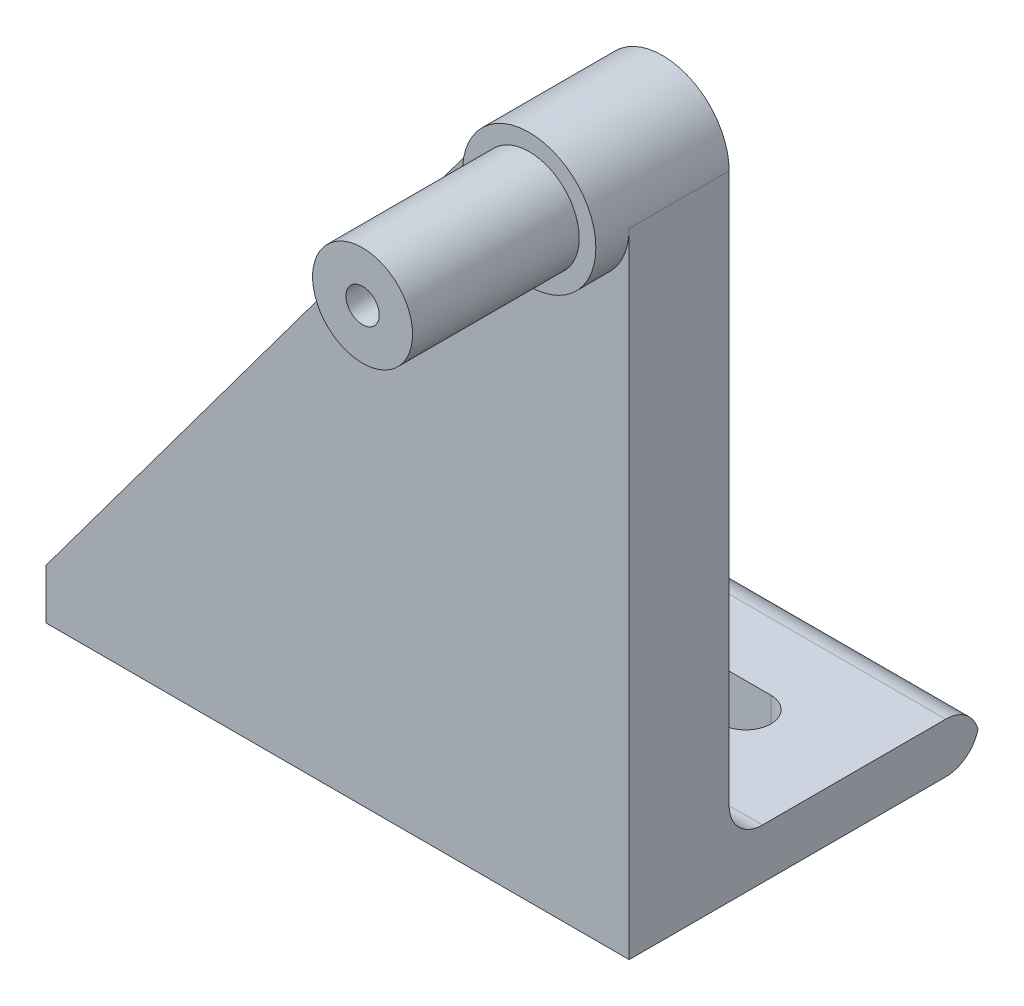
ISO-10303-21;
HEADER;
FILE_DESCRIPTION(('STEP AP214'),'2;1');
FILE_NAME('part.step','',(''),(''),'','','');
FILE_SCHEMA(('AUTOMOTIVE_DESIGN { 1 0 10303 214 1 1 1 1 }'));
ENDSEC;
DATA;
#1=APPLICATION_CONTEXT('core data for automotive mechanical design processes');
#2=APPLICATION_PROTOCOL_DEFINITION('international standard','automotive_design',2000,#1);
#3=PRODUCT_CONTEXT('',#1,'mechanical');
#4=PRODUCT('Part','Part','',(#3));
#5=PRODUCT_RELATED_PRODUCT_CATEGORY('part','',(#4));
#6=PRODUCT_DEFINITION_FORMATION('','',#4);
#7=PRODUCT_DEFINITION_CONTEXT('part definition',#1,'design');
#8=PRODUCT_DEFINITION('design','',#6,#7);
#9=PRODUCT_DEFINITION_SHAPE('','',#8);
#10=(LENGTH_UNIT() NAMED_UNIT(*) SI_UNIT(.MILLI.,.METRE.));
#11=(NAMED_UNIT(*) PLANE_ANGLE_UNIT() SI_UNIT($,.RADIAN.));
#12=(NAMED_UNIT(*) SI_UNIT($,.STERADIAN.) SOLID_ANGLE_UNIT());
#13=UNCERTAINTY_MEASURE_WITH_UNIT(LENGTH_MEASURE(1.E-05),#10,'distance_accuracy_value','');
#14=(GEOMETRIC_REPRESENTATION_CONTEXT(3) GLOBAL_UNCERTAINTY_ASSIGNED_CONTEXT((#13)) GLOBAL_UNIT_ASSIGNED_CONTEXT((#10,
#11,#12)) REPRESENTATION_CONTEXT('',''));
#15=CARTESIAN_POINT('',(0.,0.,0.));
#16=DIRECTION('',(0.,0.,1.));
#17=DIRECTION('',(1.,0.,0.));
#18=AXIS2_PLACEMENT_3D('',#15,#16,#17);
#19=CARTESIAN_POINT('',(0.,0.,0.));
#20=DIRECTION('',(0.,0.,1.));
#21=DIRECTION('',(1.,0.,0.));
#22=AXIS2_PLACEMENT_3D('',#19,#20,#21);
#23=PLANE('',#22);
#24=CARTESIAN_POINT('',(-4.,35.,0.));
#25=DIRECTION('',(0.,0.,1.));
#26=DIRECTION('',(1.,0.,0.));
#27=AXIS2_PLACEMENT_3D('',#24,#25,#26);
#28=CIRCLE('',#27,1.);
#29=CARTESIAN_POINT('',(-3.,35.,0.));
#30=VERTEX_POINT('',#29);
#31=EDGE_CURVE('E186',#30,#30,#28,.T.);
#32=ORIENTED_EDGE('',*,*,#31,.T.);
#33=EDGE_LOOP('',(#32));
#34=FACE_BOUND('',#33,.T.);
#35=DIRECTION('',(0.,1.,0.));
#36=VECTOR('',#35,1.);
#37=CARTESIAN_POINT('',(0.,0.,0.));
#38=LINE('',#37,#36);
#39=CARTESIAN_POINT('',(0.,2.,0.));
#40=VERTEX_POINT('',#39);
#41=CARTESIAN_POINT('',(0.,35.,0.));
#42=VERTEX_POINT('',#41);
#43=EDGE_CURVE('E212',#40,#42,#38,.T.);
#44=ORIENTED_EDGE('',*,*,#43,.F.);
#45=DIRECTION('',(1.,0.,0.));
#46=VECTOR('',#45,1.);
#47=CARTESIAN_POINT('',(-35.,2.,0.));
#48=LINE('',#47,#46);
#49=CARTESIAN_POINT('',(-33.5133714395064,1.99999999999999,0.));
#50=VERTEX_POINT('',#49);
#51=EDGE_CURVE('E279',#40,#50,#48,.F.);
#52=ORIENTED_EDGE('',*,*,#51,.T.);
#53=DIRECTION('',(-0.596560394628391,-0.802568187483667,0.));
#54=VECTOR('',#53,1.);
#55=CARTESIAN_POINT('',(-22.5440493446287,16.7573138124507,0.));
#56=LINE('',#55,#54);
#57=CARTESIAN_POINT('',(-7.21027274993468,37.3862415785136,0.));
#58=VERTEX_POINT('',#57);
#59=EDGE_CURVE('E222',#58,#50,#56,.T.);
#60=ORIENTED_EDGE('',*,*,#59,.F.);
#61=CARTESIAN_POINT('',(-4.,35.,0.));
#62=DIRECTION('',(0.,0.,1.));
#63=DIRECTION('',(1.,0.,0.));
#64=AXIS2_PLACEMENT_3D('',#61,#62,#63);
#65=CIRCLE('',#64,4.);
#66=EDGE_CURVE('E234',#42,#58,#65,.T.);
#67=ORIENTED_EDGE('',*,*,#66,.F.);
#68=EDGE_LOOP('',(#44,#52,#60,#67));
#69=FACE_BOUND('',#68,.T.);
#70=ADVANCED_FACE('F40',(#34,#69),#23,.F.);
#71=CARTESIAN_POINT('',(0.,0.,6.));
#72=DIRECTION('',(-1.,0.,0.));
#73=DIRECTION('',(0.,0.,1.));
#74=AXIS2_PLACEMENT_3D('',#71,#72,#73);
#75=PLANE('',#74);
#76=DIRECTION('',(0.,0.,-1.));
#77=VECTOR('',#76,1.);
#78=CARTESIAN_POINT('',(0.,-3.,6.));
#79=LINE('',#78,#77);
#80=CARTESIAN_POINT('',(0.,-3.,6.));
#81=VERTEX_POINT('',#80);
#82=CARTESIAN_POINT('',(0.,-3.,-13.));
#83=VERTEX_POINT('',#82);
#84=EDGE_CURVE('E231',#81,#83,#79,.T.);
#85=ORIENTED_EDGE('',*,*,#84,.T.);
#86=CARTESIAN_POINT('',(0.,-1.,-13.));
#87=DIRECTION('',(-1.,0.,0.));
#88=DIRECTION('',(0.,0.,1.));
#89=AXIS2_PLACEMENT_3D('',#86,#87,#88);
#90=CIRCLE('',#89,2.);
#91=CARTESIAN_POINT('',(0.,-1.5,-14.9364916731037));
#92=VERTEX_POINT('',#91);
#93=EDGE_CURVE('E269',#83,#92,#90,.F.);
#94=ORIENTED_EDGE('',*,*,#93,.T.);
#95=CARTESIAN_POINT('',(0.,-2.,-13.));
#96=DIRECTION('',(-1.,0.,0.));
#97=DIRECTION('',(0.,0.,1.));
#98=AXIS2_PLACEMENT_3D('',#95,#96,#97);
#99=CIRCLE('',#98,2.);
#100=CARTESIAN_POINT('',(0.,0.,-13.));
#101=VERTEX_POINT('',#100);
#102=EDGE_CURVE('E266',#92,#101,#99,.F.);
#103=ORIENTED_EDGE('',*,*,#102,.T.);
#104=DIRECTION('',(0.,0.,1.));
#105=VECTOR('',#104,1.);
#106=CARTESIAN_POINT('',(0.,0.,-15.));
#107=LINE('',#106,#105);
#108=CARTESIAN_POINT('',(0.,0.,-2.));
#109=VERTEX_POINT('',#108);
#110=EDGE_CURVE('E190',#101,#109,#107,.T.);
#111=ORIENTED_EDGE('',*,*,#110,.T.);
#112=CARTESIAN_POINT('',(0.,2.,-2.));
#113=DIRECTION('',(-1.,0.,0.));
#114=DIRECTION('',(0.,0.,1.));
#115=AXIS2_PLACEMENT_3D('',#112,#113,#114);
#116=CIRCLE('',#115,2.);
#117=EDGE_CURVE('E50',#109,#40,#116,.T.);
#118=ORIENTED_EDGE('',*,*,#117,.T.);
#119=ORIENTED_EDGE('',*,*,#43,.T.);
#120=DIRECTION('',(0.,0.,-1.));
#121=VECTOR('',#120,1.);
#122=CARTESIAN_POINT('',(0.,35.,6.));
#123=LINE('',#122,#121);
#124=CARTESIAN_POINT('',(0.,35.,6.));
#125=VERTEX_POINT('',#124);
#126=EDGE_CURVE('E216',#125,#42,#123,.T.);
#127=ORIENTED_EDGE('',*,*,#126,.F.);
#128=DIRECTION('',(0.,1.,0.));
#129=VECTOR('',#128,1.);
#130=CARTESIAN_POINT('',(0.,0.,6.));
#131=LINE('',#130,#129);
#132=EDGE_CURVE('E217',#81,#125,#131,.T.);
#133=ORIENTED_EDGE('',*,*,#132,.F.);
#134=EDGE_LOOP('',(#85,#94,#103,#111,#118,#119,#127,#133));
#135=FACE_BOUND('',#134,.T.);
#136=ADVANCED_FACE('F285',(#135),#75,.F.);
#137=CARTESIAN_POINT('',(-4.,35.,6.));
#138=DIRECTION('',(0.,0.,-1.));
#139=DIRECTION('',(-1.,0.,0.));
#140=AXIS2_PLACEMENT_3D('',#137,#138,#139);
#141=CYLINDRICAL_SURFACE('',#140,4.);
#142=ORIENTED_EDGE('',*,*,#66,.T.);
#143=DIRECTION('',(0.,0.,-1.));
#144=VECTOR('',#143,1.);
#145=CARTESIAN_POINT('',(-7.21027274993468,37.3862415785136,6.));
#146=LINE('',#145,#144);
#147=CARTESIAN_POINT('',(-7.21027274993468,37.3862415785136,6.));
#148=VERTEX_POINT('',#147);
#149=EDGE_CURVE('E250',#148,#58,#146,.T.);
#150=ORIENTED_EDGE('',*,*,#149,.F.);
#151=CARTESIAN_POINT('',(-4.,35.,6.));
#152=DIRECTION('',(0.,0.,1.));
#153=DIRECTION('',(1.,0.,0.));
#154=AXIS2_PLACEMENT_3D('',#151,#152,#153);
#155=CIRCLE('',#154,4.);
#156=EDGE_CURVE('E208',#148,#125,#155,.T.);
#157=ORIENTED_EDGE('',*,*,#156,.T.);
#158=ORIENTED_EDGE('',*,*,#126,.T.);
#159=EDGE_LOOP('',(#142,#150,#157,#158));
#160=FACE_BOUND('',#159,.T.);
#161=CARTESIAN_POINT('',(-4.,35.,8.));
#162=DIRECTION('',(0.,0.,1.));
#163=DIRECTION('',(1.,0.,0.));
#164=AXIS2_PLACEMENT_3D('',#161,#162,#163);
#165=CIRCLE('',#164,4.);
#166=CARTESIAN_POINT('',(0.,35.,8.));
#167=VERTEX_POINT('',#166);
#168=EDGE_CURVE('E202',#167,#167,#165,.T.);
#169=ORIENTED_EDGE('',*,*,#168,.F.);
#170=EDGE_LOOP('',(#169));
#171=FACE_BOUND('',#170,.T.);
#172=ADVANCED_FACE('F301',(#160,#171),#141,.T.);
#173=CARTESIAN_POINT('',(-22.5440493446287,16.7573138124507,6.));
#174=DIRECTION('',(0.802568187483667,-0.596560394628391,0.));
#175=DIRECTION('',(0.596560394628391,0.802568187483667,0.));
#176=AXIS2_PLACEMENT_3D('',#173,#174,#175);
#177=PLANE('',#176);
#178=ORIENTED_EDGE('',*,*,#59,.T.);
#179=CARTESIAN_POINT('',(-33.5133714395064,2.,-2.));
#180=DIRECTION('',(0.802568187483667,-0.596560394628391,0.));
#181=DIRECTION('',(-0.596560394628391,-0.802568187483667,0.));
#182=AXIS2_PLACEMENT_3D('',#179,#180,#181);
#183=ELLIPSE('',#182,2.49200009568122,2.);
#184=CARTESIAN_POINT('',(-35.,0.,-2.));
#185=VERTEX_POINT('',#184);
#186=EDGE_CURVE('E11',#50,#185,#183,.T.);
#187=ORIENTED_EDGE('',*,*,#186,.T.);
#188=DIRECTION('',(0.,0.,-1.));
#189=VECTOR('',#188,1.);
#190=CARTESIAN_POINT('',(-35.,0.,6.));
#191=LINE('',#190,#189);
#192=CARTESIAN_POINT('',(-35.,0.,6.));
#193=VERTEX_POINT('',#192);
#194=EDGE_CURVE('E247',#193,#185,#191,.T.);
#195=ORIENTED_EDGE('',*,*,#194,.F.);
#196=DIRECTION('',(-0.596560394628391,-0.802568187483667,0.));
#197=VECTOR('',#196,1.);
#198=CARTESIAN_POINT('',(-22.5440493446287,16.7573138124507,6.));
#199=LINE('',#198,#197);
#200=EDGE_CURVE('E221',#148,#193,#199,.T.);
#201=ORIENTED_EDGE('',*,*,#200,.F.);
#202=ORIENTED_EDGE('',*,*,#149,.T.);
#203=EDGE_LOOP('',(#178,#187,#195,#201,#202));
#204=FACE_BOUND('',#203,.T.);
#205=ADVANCED_FACE('F296',(#204),#177,.F.);
#206=CARTESIAN_POINT('',(-35.,0.,6.));
#207=DIRECTION('',(1.,0.,0.));
#208=DIRECTION('',(0.,0.,-1.));
#209=AXIS2_PLACEMENT_3D('',#206,#207,#208);
#210=PLANE('',#209);
#211=CARTESIAN_POINT('',(-35.,-2.,-13.));
#212=DIRECTION('',(1.,0.,0.));
#213=DIRECTION('',(0.,0.,-1.));
#214=AXIS2_PLACEMENT_3D('',#211,#212,#213);
#215=CIRCLE('',#214,2.);
#216=CARTESIAN_POINT('',(-35.,0.,-13.));
#217=VERTEX_POINT('',#216);
#218=CARTESIAN_POINT('',(-35.,-1.5,-14.9364916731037));
#219=VERTEX_POINT('',#218);
#220=EDGE_CURVE('E207',#217,#219,#215,.F.);
#221=ORIENTED_EDGE('',*,*,#220,.T.);
#222=CARTESIAN_POINT('',(-35.,-1.,-13.));
#223=DIRECTION('',(1.,0.,0.));
#224=DIRECTION('',(0.,0.,-1.));
#225=AXIS2_PLACEMENT_3D('',#222,#223,#224);
#226=CIRCLE('',#225,2.);
#227=CARTESIAN_POINT('',(-35.,-3.,-13.));
#228=VERTEX_POINT('',#227);
#229=EDGE_CURVE('E259',#219,#228,#226,.F.);
#230=ORIENTED_EDGE('',*,*,#229,.T.);
#231=DIRECTION('',(0.,0.,-1.));
#232=VECTOR('',#231,1.);
#233=CARTESIAN_POINT('',(-35.,-3.,6.));
#234=LINE('',#233,#232);
#235=CARTESIAN_POINT('',(-35.,-3.,6.));
#236=VERTEX_POINT('',#235);
#237=EDGE_CURVE('E243',#236,#228,#234,.T.);
#238=ORIENTED_EDGE('',*,*,#237,.F.);
#239=DIRECTION('',(0.,-1.,0.));
#240=VECTOR('',#239,1.);
#241=CARTESIAN_POINT('',(-35.,0.,6.));
#242=LINE('',#241,#240);
#243=EDGE_CURVE('E225',#193,#236,#242,.T.);
#244=ORIENTED_EDGE('',*,*,#243,.F.);
#245=ORIENTED_EDGE('',*,*,#194,.T.);
#246=DIRECTION('',(0.,0.,1.));
#247=VECTOR('',#246,1.);
#248=CARTESIAN_POINT('',(-35.,0.,-15.));
#249=LINE('',#248,#247);
#250=EDGE_CURVE('E194',#217,#185,#249,.T.);
#251=ORIENTED_EDGE('',*,*,#250,.F.);
#252=EDGE_LOOP('',(#221,#230,#238,#244,#245,#251));
#253=FACE_BOUND('',#252,.T.);
#254=ADVANCED_FACE('F324',(#253),#210,.F.);
#255=CARTESIAN_POINT('',(0.,-3.,6.));
#256=DIRECTION('',(0.,1.,0.));
#257=DIRECTION('',(0.,0.,1.));
#258=AXIS2_PLACEMENT_3D('',#255,#256,#257);
#259=PLANE('',#258);
#260=DIRECTION('',(-1.,0.,0.));
#261=VECTOR('',#260,1.);
#262=CARTESIAN_POINT('',(0.,-3.,-9.00000000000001));
#263=LINE('',#262,#261);
#264=CARTESIAN_POINT('',(-6.5,-3.,-9.));
#265=VERTEX_POINT('',#264);
#266=CARTESIAN_POINT('',(-28.5,-3.,-9.));
#267=VERTEX_POINT('',#266);
#268=EDGE_CURVE('E174',#265,#267,#263,.T.);
#269=ORIENTED_EDGE('',*,*,#268,.T.);
#270=CARTESIAN_POINT('',(-28.5,-3.,-7.5));
#271=DIRECTION('',(0.,1.,0.));
#272=DIRECTION('',(0.,0.,1.));
#273=AXIS2_PLACEMENT_3D('',#270,#271,#272);
#274=CIRCLE('',#273,1.5);
#275=CARTESIAN_POINT('',(-28.5,-3.,-6.));
#276=VERTEX_POINT('',#275);
#277=EDGE_CURVE('E178',#267,#276,#274,.T.);
#278=ORIENTED_EDGE('',*,*,#277,.T.);
#279=DIRECTION('',(1.,0.,0.));
#280=VECTOR('',#279,1.);
#281=CARTESIAN_POINT('',(0.,-3.,-6.00000000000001));
#282=LINE('',#281,#280);
#283=CARTESIAN_POINT('',(-6.5,-3.,-6.));
#284=VERTEX_POINT('',#283);
#285=EDGE_CURVE('E165',#276,#284,#282,.T.);
#286=ORIENTED_EDGE('',*,*,#285,.T.);
#287=CARTESIAN_POINT('',(-6.5,-3.,-7.5));
#288=DIRECTION('',(0.,1.,0.));
#289=DIRECTION('',(0.,0.,1.));
#290=AXIS2_PLACEMENT_3D('',#287,#288,#289);
#291=CIRCLE('',#290,1.5);
#292=EDGE_CURVE('E140',#284,#265,#291,.T.);
#293=ORIENTED_EDGE('',*,*,#292,.T.);
#294=EDGE_LOOP('',(#269,#278,#286,#293));
#295=FACE_BOUND('',#294,.T.);
#296=ORIENTED_EDGE('',*,*,#237,.T.);
#297=DIRECTION('',(-1.,0.,0.));
#298=VECTOR('',#297,1.);
#299=CARTESIAN_POINT('',(0.,-3.,-13.));
#300=LINE('',#299,#298);
#301=EDGE_CURVE('E262',#228,#83,#300,.F.);
#302=ORIENTED_EDGE('',*,*,#301,.T.);
#303=ORIENTED_EDGE('',*,*,#84,.F.);
#304=DIRECTION('',(1.,0.,0.));
#305=VECTOR('',#304,1.);
#306=CARTESIAN_POINT('',(0.,-3.,6.));
#307=LINE('',#306,#305);
#308=EDGE_CURVE('E228',#236,#81,#307,.T.);
#309=ORIENTED_EDGE('',*,*,#308,.F.);
#310=EDGE_LOOP('',(#296,#302,#303,#309));
#311=FACE_BOUND('',#310,.T.);
#312=ADVANCED_FACE('F310',(#295,#311),#259,.F.);
#313=CARTESIAN_POINT('',(0.,0.,6.));
#314=DIRECTION('',(0.,0.,1.));
#315=DIRECTION('',(1.,0.,0.));
#316=AXIS2_PLACEMENT_3D('',#313,#314,#315);
#317=PLANE('',#316);
#318=ORIENTED_EDGE('',*,*,#156,.F.);
#319=ORIENTED_EDGE('',*,*,#200,.T.);
#320=ORIENTED_EDGE('',*,*,#243,.T.);
#321=ORIENTED_EDGE('',*,*,#308,.T.);
#322=ORIENTED_EDGE('',*,*,#132,.T.);
#323=EDGE_LOOP('',(#318,#319,#320,#321,#322));
#324=FACE_BOUND('',#323,.T.);
#325=ADVANCED_FACE('F305',(#324),#317,.T.);
#326=CARTESIAN_POINT('',(-4.,35.,8.));
#327=DIRECTION('',(0.,0.,1.));
#328=DIRECTION('',(1.,0.,0.));
#329=AXIS2_PLACEMENT_3D('',#326,#327,#328);
#330=PLANE('',#329);
#331=CARTESIAN_POINT('',(-4.,35.,8.));
#332=DIRECTION('',(0.,0.,1.));
#333=DIRECTION('',(1.,0.,0.));
#334=AXIS2_PLACEMENT_3D('',#331,#332,#333);
#335=CIRCLE('',#334,3.);
#336=CARTESIAN_POINT('',(-0.999999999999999,35.,8.));
#337=VERTEX_POINT('',#336);
#338=EDGE_CURVE('E203',#337,#337,#335,.T.);
#339=ORIENTED_EDGE('',*,*,#338,.F.);
#340=EDGE_LOOP('',(#339));
#341=FACE_BOUND('',#340,.T.);
#342=ORIENTED_EDGE('',*,*,#168,.T.);
#343=EDGE_LOOP('',(#342));
#344=FACE_BOUND('',#343,.T.);
#345=ADVANCED_FACE('F472',(#341,#344),#330,.T.);
#346=CARTESIAN_POINT('',(-4.,35.,18.));
#347=DIRECTION('',(0.,0.,-1.));
#348=DIRECTION('',(-1.,0.,0.));
#349=AXIS2_PLACEMENT_3D('',#346,#347,#348);
#350=CYLINDRICAL_SURFACE('',#349,3.);
#351=CARTESIAN_POINT('',(-4.,35.,18.));
#352=DIRECTION('',(0.,0.,1.));
#353=DIRECTION('',(1.,0.,0.));
#354=AXIS2_PLACEMENT_3D('',#351,#352,#353);
#355=CIRCLE('',#354,3.);
#356=CARTESIAN_POINT('',(-0.999999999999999,35.,18.));
#357=VERTEX_POINT('',#356);
#358=EDGE_CURVE('E198',#357,#357,#355,.T.);
#359=ORIENTED_EDGE('',*,*,#358,.F.);
#360=EDGE_LOOP('',(#359));
#361=FACE_BOUND('',#360,.T.);
#362=ORIENTED_EDGE('',*,*,#338,.T.);
#363=EDGE_LOOP('',(#362));
#364=FACE_BOUND('',#363,.T.);
#365=ADVANCED_FACE('F338',(#361,#364),#350,.T.);
#366=CARTESIAN_POINT('',(-4.,35.,18.));
#367=DIRECTION('',(0.,0.,1.));
#368=DIRECTION('',(1.,0.,0.));
#369=AXIS2_PLACEMENT_3D('',#366,#367,#368);
#370=PLANE('',#369);
#371=CARTESIAN_POINT('',(-4.,35.,18.));
#372=DIRECTION('',(0.,0.,1.));
#373=DIRECTION('',(1.,0.,0.));
#374=AXIS2_PLACEMENT_3D('',#371,#372,#373);
#375=CIRCLE('',#374,1.);
#376=CARTESIAN_POINT('',(-3.,35.,18.));
#377=VERTEX_POINT('',#376);
#378=EDGE_CURVE('E182',#377,#377,#375,.T.);
#379=ORIENTED_EDGE('',*,*,#378,.F.);
#380=EDGE_LOOP('',(#379));
#381=FACE_BOUND('',#380,.T.);
#382=ORIENTED_EDGE('',*,*,#358,.T.);
#383=EDGE_LOOP('',(#382));
#384=FACE_BOUND('',#383,.T.);
#385=ADVANCED_FACE('F328',(#381,#384),#370,.T.);
#386=CARTESIAN_POINT('',(0.,0.,-15.));
#387=DIRECTION('',(0.,-1.,0.));
#388=DIRECTION('',(0.,0.,-1.));
#389=AXIS2_PLACEMENT_3D('',#386,#387,#388);
#390=PLANE('',#389);
#391=DIRECTION('',(1.,0.,0.));
#392=VECTOR('',#391,1.);
#393=CARTESIAN_POINT('',(-28.5,0.,-6.));
#394=LINE('',#393,#392);
#395=CARTESIAN_POINT('',(-28.5,0.,-6.));
#396=VERTEX_POINT('',#395);
#397=CARTESIAN_POINT('',(-6.5,0.,-6.00000000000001));
#398=VERTEX_POINT('',#397);
#399=EDGE_CURVE('E147',#396,#398,#394,.T.);
#400=ORIENTED_EDGE('',*,*,#399,.F.);
#401=CARTESIAN_POINT('',(-28.5,0.,-7.5));
#402=DIRECTION('',(0.,1.,0.));
#403=DIRECTION('',(0.,0.,1.));
#404=AXIS2_PLACEMENT_3D('',#401,#402,#403);
#405=CIRCLE('',#404,1.5);
#406=CARTESIAN_POINT('',(-28.5,0.,-9.));
#407=VERTEX_POINT('',#406);
#408=EDGE_CURVE('E65',#407,#396,#405,.T.);
#409=ORIENTED_EDGE('',*,*,#408,.F.);
#410=DIRECTION('',(-1.,0.,0.));
#411=VECTOR('',#410,1.);
#412=CARTESIAN_POINT('',(-28.5,0.,-9.));
#413=LINE('',#412,#411);
#414=CARTESIAN_POINT('',(-6.5,0.,-9.));
#415=VERTEX_POINT('',#414);
#416=EDGE_CURVE('E155',#415,#407,#413,.T.);
#417=ORIENTED_EDGE('',*,*,#416,.F.);
#418=CARTESIAN_POINT('',(-6.5,0.,-7.5));
#419=DIRECTION('',(0.,1.,0.));
#420=DIRECTION('',(0.,0.,1.));
#421=AXIS2_PLACEMENT_3D('',#418,#419,#420);
#422=CIRCLE('',#421,1.5);
#423=EDGE_CURVE('E137',#398,#415,#422,.T.);
#424=ORIENTED_EDGE('',*,*,#423,.F.);
#425=EDGE_LOOP('',(#400,#409,#417,#424));
#426=FACE_BOUND('',#425,.T.);
#427=ORIENTED_EDGE('',*,*,#110,.F.);
#428=DIRECTION('',(1.,0.,0.));
#429=VECTOR('',#428,1.);
#430=CARTESIAN_POINT('',(0.,0.,-13.));
#431=LINE('',#430,#429);
#432=EDGE_CURVE('E276',#101,#217,#431,.F.);
#433=ORIENTED_EDGE('',*,*,#432,.T.);
#434=ORIENTED_EDGE('',*,*,#250,.T.);
#435=DIRECTION('',(1.,0.,0.));
#436=VECTOR('',#435,1.);
#437=CARTESIAN_POINT('',(0.,0.,-2.));
#438=LINE('',#437,#436);
#439=EDGE_CURVE('E272',#185,#109,#438,.T.);
#440=ORIENTED_EDGE('',*,*,#439,.T.);
#441=EDGE_LOOP('',(#427,#433,#434,#440));
#442=FACE_BOUND('',#441,.T.);
#443=ADVANCED_FACE('F152',(#426,#442),#390,.F.);
#444=CARTESIAN_POINT('',(-4.,35.,-14.));
#445=DIRECTION('',(0.,0.,1.));
#446=DIRECTION('',(1.,0.,0.));
#447=AXIS2_PLACEMENT_3D('',#444,#445,#446);
#448=CYLINDRICAL_SURFACE('',#447,1.);
#449=ORIENTED_EDGE('',*,*,#378,.T.);
#450=EDGE_LOOP('',(#449));
#451=FACE_BOUND('',#450,.T.);
#452=ORIENTED_EDGE('',*,*,#31,.F.);
#453=EDGE_LOOP('',(#452));
#454=FACE_BOUND('',#453,.T.);
#455=ADVANCED_FACE('F327',(#451,#454),#448,.F.);
#456=CARTESIAN_POINT('',(0.,-2.,-13.));
#457=DIRECTION('',(1.,0.,0.));
#458=DIRECTION('',(0.,0.,-1.));
#459=AXIS2_PLACEMENT_3D('',#456,#457,#458);
#460=CYLINDRICAL_SURFACE('',#459,2.);
#461=ORIENTED_EDGE('',*,*,#432,.F.);
#462=ORIENTED_EDGE('',*,*,#102,.F.);
#463=DIRECTION('',(1.,0.,0.));
#464=VECTOR('',#463,1.);
#465=CARTESIAN_POINT('',(-17.5,-1.5,-14.9364916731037));
#466=LINE('',#465,#464);
#467=EDGE_CURVE('E44',#219,#92,#466,.T.);
#468=ORIENTED_EDGE('',*,*,#467,.F.);
#469=ORIENTED_EDGE('',*,*,#220,.F.);
#470=EDGE_LOOP('',(#461,#462,#468,#469));
#471=FACE_BOUND('',#470,.T.);
#472=ADVANCED_FACE('F318',(#471),#460,.T.);
#473=CARTESIAN_POINT('',(0.,-1.,-13.));
#474=DIRECTION('',(-1.,0.,0.));
#475=DIRECTION('',(0.,0.,1.));
#476=AXIS2_PLACEMENT_3D('',#473,#474,#475);
#477=CYLINDRICAL_SURFACE('',#476,2.);
#478=ORIENTED_EDGE('',*,*,#93,.F.);
#479=ORIENTED_EDGE('',*,*,#301,.F.);
#480=ORIENTED_EDGE('',*,*,#229,.F.);
#481=ORIENTED_EDGE('',*,*,#467,.T.);
#482=EDGE_LOOP('',(#478,#479,#480,#481));
#483=FACE_BOUND('',#482,.T.);
#484=ADVANCED_FACE('F321',(#483),#477,.T.);
#485=CARTESIAN_POINT('',(0.,2.,-2.));
#486=DIRECTION('',(-1.,0.,0.));
#487=DIRECTION('',(0.,0.,1.));
#488=AXIS2_PLACEMENT_3D('',#485,#486,#487);
#489=CYLINDRICAL_SURFACE('',#488,2.);
#490=ORIENTED_EDGE('',*,*,#186,.F.);
#491=ORIENTED_EDGE('',*,*,#51,.F.);
#492=ORIENTED_EDGE('',*,*,#117,.F.);
#493=ORIENTED_EDGE('',*,*,#439,.F.);
#494=EDGE_LOOP('',(#490,#491,#492,#493));
#495=FACE_BOUND('',#494,.T.);
#496=ADVANCED_FACE('F42',(#495),#489,.F.);
#497=CARTESIAN_POINT('',(-28.5,-32.,-7.5));
#498=DIRECTION('',(0.,1.,0.));
#499=DIRECTION('',(0.,0.,1.));
#500=AXIS2_PLACEMENT_3D('',#497,#498,#499);
#501=CYLINDRICAL_SURFACE('',#500,1.5);
#502=DIRECTION('',(0.,1.,0.));
#503=VECTOR('',#502,1.);
#504=CARTESIAN_POINT('',(-28.5,-32.,-9.));
#505=LINE('',#504,#503);
#506=EDGE_CURVE('E162',#267,#407,#505,.T.);
#507=ORIENTED_EDGE('',*,*,#506,.T.);
#508=ORIENTED_EDGE('',*,*,#408,.T.);
#509=DIRECTION('',(0.,1.,0.));
#510=VECTOR('',#509,1.);
#511=CARTESIAN_POINT('',(-28.5,-32.,-6.));
#512=LINE('',#511,#510);
#513=EDGE_CURVE('E144',#276,#396,#512,.T.);
#514=ORIENTED_EDGE('',*,*,#513,.F.);
#515=ORIENTED_EDGE('',*,*,#277,.F.);
#516=EDGE_LOOP('',(#507,#508,#514,#515));
#517=FACE_BOUND('',#516,.T.);
#518=ADVANCED_FACE('F375',(#517),#501,.F.);
#519=CARTESIAN_POINT('',(-28.5,-32.,-9.));
#520=DIRECTION('',(0.,0.,-1.));
#521=DIRECTION('',(-1.,0.,0.));
#522=AXIS2_PLACEMENT_3D('',#519,#520,#521);
#523=PLANE('',#522);
#524=DIRECTION('',(0.,1.,0.));
#525=VECTOR('',#524,1.);
#526=CARTESIAN_POINT('',(-6.5,-32.,-9.));
#527=LINE('',#526,#525);
#528=EDGE_CURVE('E143',#265,#415,#527,.T.);
#529=ORIENTED_EDGE('',*,*,#528,.T.);
#530=ORIENTED_EDGE('',*,*,#416,.T.);
#531=ORIENTED_EDGE('',*,*,#506,.F.);
#532=ORIENTED_EDGE('',*,*,#268,.F.);
#533=EDGE_LOOP('',(#529,#530,#531,#532));
#534=FACE_BOUND('',#533,.T.);
#535=ADVANCED_FACE('F380',(#534),#523,.F.);
#536=CARTESIAN_POINT('',(-6.5,-32.,-7.5));
#537=DIRECTION('',(0.,1.,0.));
#538=DIRECTION('',(0.,0.,1.));
#539=AXIS2_PLACEMENT_3D('',#536,#537,#538);
#540=CYLINDRICAL_SURFACE('',#539,1.5);
#541=DIRECTION('',(0.,1.,0.));
#542=VECTOR('',#541,1.);
#543=CARTESIAN_POINT('',(-6.5,-32.,-6.00000000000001));
#544=LINE('',#543,#542);
#545=EDGE_CURVE('E57',#284,#398,#544,.T.);
#546=ORIENTED_EDGE('',*,*,#545,.T.);
#547=ORIENTED_EDGE('',*,*,#423,.T.);
#548=ORIENTED_EDGE('',*,*,#528,.F.);
#549=ORIENTED_EDGE('',*,*,#292,.F.);
#550=EDGE_LOOP('',(#546,#547,#548,#549));
#551=FACE_BOUND('',#550,.T.);
#552=ADVANCED_FACE('F134',(#551),#540,.F.);
#553=CARTESIAN_POINT('',(-28.5,-32.,-6.));
#554=DIRECTION('',(0.,0.,1.));
#555=DIRECTION('',(1.,0.,0.));
#556=AXIS2_PLACEMENT_3D('',#553,#554,#555);
#557=PLANE('',#556);
#558=ORIENTED_EDGE('',*,*,#513,.T.);
#559=ORIENTED_EDGE('',*,*,#399,.T.);
#560=ORIENTED_EDGE('',*,*,#545,.F.);
#561=ORIENTED_EDGE('',*,*,#285,.F.);
#562=EDGE_LOOP('',(#558,#559,#560,#561));
#563=FACE_BOUND('',#562,.T.);
#564=ADVANCED_FACE('F148',(#563),#557,.F.);
#565=CLOSED_SHELL('',(#70,#136,#172,#205,#254,#312,#325,#345,#365,#385,#443,#455,#472,#484,#496,
#518,#535,#552,#564));
#566=MANIFOLD_SOLID_BREP('B2',#565);
#567=ADVANCED_BREP_SHAPE_REPRESENTATION('',(#18,#566),#14);
#568=SHAPE_DEFINITION_REPRESENTATION(#9,#567);
ENDSEC;
END-ISO-10303-21;
